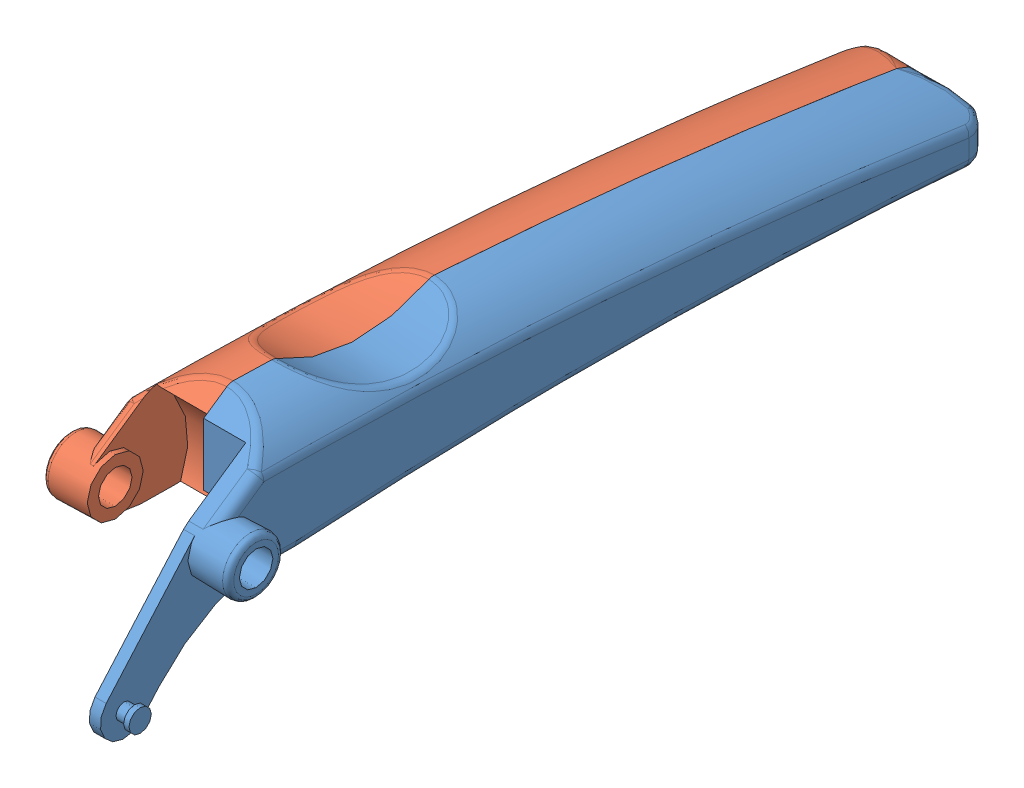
SolidWorks assembly Handle Assembly_&.sldasm, configuration Default (file format 13000). Lengths in mm.
Overall size (26.32 29.18 124.41).
2 component instances, 2 part files, 0 mates.
Components (placement in the parent):
- Handle - Right Side_&-1: Handle - Right Side_&.SLDPRT [Default] at origin size (14.33 29.18 124.41)
- Handle - Left Side_&-1: Handle - Left Side_&.SLDPRT [Default] at origin size (14.08 18.38 112)
